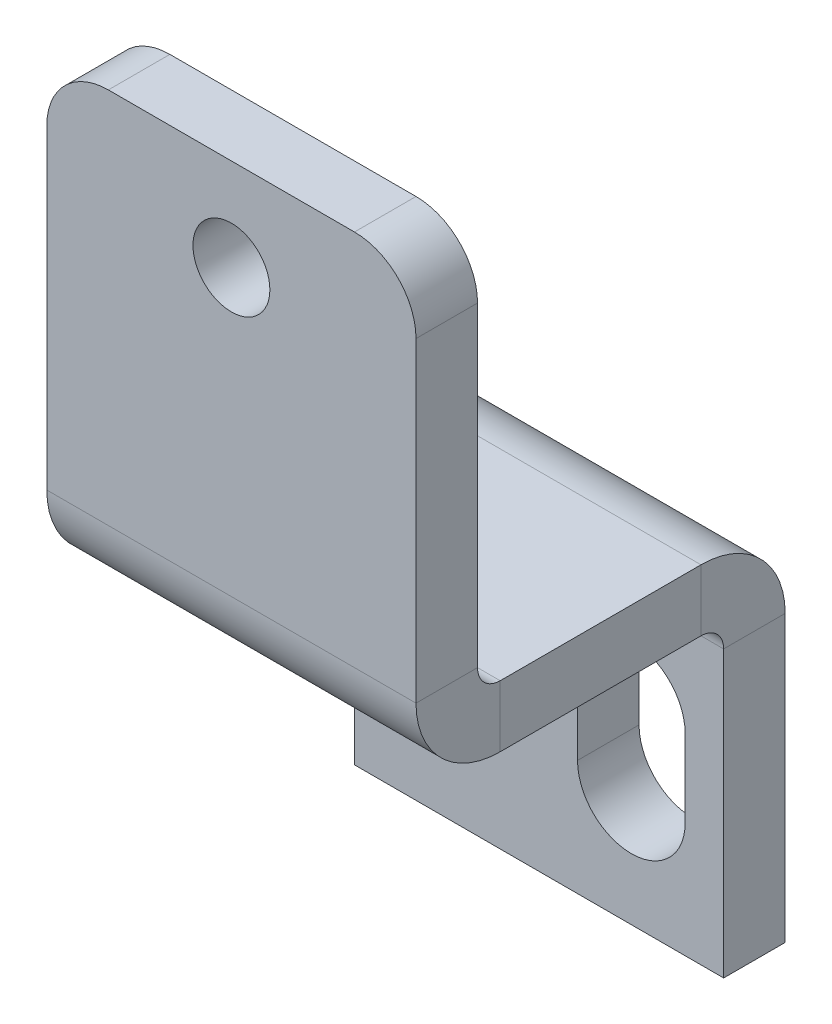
ISO-10303-21;
HEADER;
FILE_DESCRIPTION(('STEP AP214'),'2;1');
FILE_NAME('part.step','',(''),(''),'','','');
FILE_SCHEMA(('AUTOMOTIVE_DESIGN { 1 0 10303 214 1 1 1 1 }'));
ENDSEC;
DATA;
#1=APPLICATION_CONTEXT('core data for automotive mechanical design processes');
#2=APPLICATION_PROTOCOL_DEFINITION('international standard','automotive_design',2000,#1);
#3=PRODUCT_CONTEXT('',#1,'mechanical');
#4=PRODUCT('Part','Part','',(#3));
#5=PRODUCT_RELATED_PRODUCT_CATEGORY('part','',(#4));
#6=PRODUCT_DEFINITION_FORMATION('','',#4);
#7=PRODUCT_DEFINITION_CONTEXT('part definition',#1,'design');
#8=PRODUCT_DEFINITION('design','',#6,#7);
#9=PRODUCT_DEFINITION_SHAPE('','',#8);
#10=(LENGTH_UNIT() NAMED_UNIT(*) SI_UNIT(.MILLI.,.METRE.));
#11=(NAMED_UNIT(*) PLANE_ANGLE_UNIT() SI_UNIT($,.RADIAN.));
#12=(NAMED_UNIT(*) SI_UNIT($,.STERADIAN.) SOLID_ANGLE_UNIT());
#13=UNCERTAINTY_MEASURE_WITH_UNIT(LENGTH_MEASURE(1.E-05),#10,'distance_accuracy_value','');
#14=(GEOMETRIC_REPRESENTATION_CONTEXT(3) GLOBAL_UNCERTAINTY_ASSIGNED_CONTEXT((#13)) GLOBAL_UNIT_ASSIGNED_CONTEXT((#10,
#11,#12)) REPRESENTATION_CONTEXT('',''));
#15=CARTESIAN_POINT('',(0.,0.,0.));
#16=DIRECTION('',(0.,0.,1.));
#17=DIRECTION('',(1.,0.,0.));
#18=AXIS2_PLACEMENT_3D('',#15,#16,#17);
#19=CARTESIAN_POINT('',(0.,0.,0.));
#20=DIRECTION('',(0.,0.,1.));
#21=DIRECTION('',(1.,0.,0.));
#22=AXIS2_PLACEMENT_3D('',#19,#20,#21);
#23=PLANE('',#22);
#24=DIRECTION('',(0.,1.,0.));
#25=VECTOR('',#24,1.);
#26=CARTESIAN_POINT('',(317.25,15.0793919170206,0.));
#27=LINE('',#26,#25);
#28=CARTESIAN_POINT('',(317.25,15.0793919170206,0.));
#29=VERTEX_POINT('',#28);
#30=CARTESIAN_POINT('',(317.25,17.5793919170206,0.));
#31=VERTEX_POINT('',#30);
#32=EDGE_CURVE('E203',#29,#31,#27,.T.);
#33=ORIENTED_EDGE('',*,*,#32,.T.);
#34=CARTESIAN_POINT('',(319.,17.5793919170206,0.));
#35=DIRECTION('',(0.,0.,1.));
#36=DIRECTION('',(1.,0.,0.));
#37=AXIS2_PLACEMENT_3D('',#34,#35,#36);
#38=CIRCLE('',#37,1.74999999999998);
#39=CARTESIAN_POINT('',(320.75,17.5793919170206,0.));
#40=VERTEX_POINT('',#39);
#41=EDGE_CURVE('E219',#40,#31,#38,.T.);
#42=ORIENTED_EDGE('',*,*,#41,.F.);
#43=DIRECTION('',(0.,1.,0.));
#44=VECTOR('',#43,1.);
#45=CARTESIAN_POINT('',(320.75,15.0793919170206,0.));
#46=LINE('',#45,#44);
#47=CARTESIAN_POINT('',(320.75,15.0793919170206,0.));
#48=VERTEX_POINT('',#47);
#49=EDGE_CURVE('E196',#48,#40,#46,.T.);
#50=ORIENTED_EDGE('',*,*,#49,.F.);
#51=CARTESIAN_POINT('',(319.,15.0793919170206,0.));
#52=DIRECTION('',(0.,0.,1.));
#53=DIRECTION('',(1.,0.,0.));
#54=AXIS2_PLACEMENT_3D('',#51,#52,#53);
#55=CIRCLE('',#54,1.74999999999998);
#56=EDGE_CURVE('E209',#29,#48,#55,.T.);
#57=ORIENTED_EDGE('',*,*,#56,.F.);
#58=EDGE_LOOP('',(#33,#42,#50,#57));
#59=FACE_BOUND('',#58,.T.);
#60=DIRECTION('',(0.,1.,0.));
#61=VECTOR('',#60,1.);
#62=CARTESIAN_POINT('',(322.,23.3293919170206,0.));
#63=LINE('',#62,#61);
#64=CARTESIAN_POINT('',(322.,11.3293919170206,0.));
#65=VERTEX_POINT('',#64);
#66=CARTESIAN_POINT('',(322.,20.5927919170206,0.));
#67=VERTEX_POINT('',#66);
#68=EDGE_CURVE('E329',#65,#67,#63,.T.);
#69=ORIENTED_EDGE('',*,*,#68,.T.);
#70=DIRECTION('',(-1.,0.,0.));
#71=VECTOR('',#70,1.);
#72=CARTESIAN_POINT('',(310.,20.5927919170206,0.));
#73=LINE('',#72,#71);
#74=CARTESIAN_POINT('',(310.,20.5927919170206,0.));
#75=VERTEX_POINT('',#74);
#76=EDGE_CURVE('E315',#75,#67,#73,.F.);
#77=ORIENTED_EDGE('',*,*,#76,.F.);
#78=DIRECTION('',(0.,-1.,0.));
#79=VECTOR('',#78,1.);
#80=CARTESIAN_POINT('',(310.,11.3293919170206,0.));
#81=LINE('',#80,#79);
#82=CARTESIAN_POINT('',(310.,11.3293919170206,0.));
#83=VERTEX_POINT('',#82);
#84=EDGE_CURVE('E323',#75,#83,#81,.T.);
#85=ORIENTED_EDGE('',*,*,#84,.T.);
#86=DIRECTION('',(1.,0.,0.));
#87=VECTOR('',#86,1.);
#88=CARTESIAN_POINT('',(322.,11.3293919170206,0.));
#89=LINE('',#88,#87);
#90=EDGE_CURVE('E337',#83,#65,#89,.T.);
#91=ORIENTED_EDGE('',*,*,#90,.T.);
#92=EDGE_LOOP('',(#69,#77,#85,#91));
#93=FACE_BOUND('',#92,.T.);
#94=CARTESIAN_POINT('',(313.,15.0793919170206,0.));
#95=DIRECTION('',(0.,0.,1.));
#96=DIRECTION('',(1.,0.,0.));
#97=AXIS2_PLACEMENT_3D('',#94,#95,#96);
#98=CIRCLE('',#97,1.74999999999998);
#99=CARTESIAN_POINT('',(311.25,15.0793919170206,0.));
#100=VERTEX_POINT('',#99);
#101=CARTESIAN_POINT('',(314.75,15.0793919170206,0.));
#102=VERTEX_POINT('',#101);
#103=EDGE_CURVE('E176',#100,#102,#98,.T.);
#104=ORIENTED_EDGE('',*,*,#103,.F.);
#105=DIRECTION('',(0.,1.,0.));
#106=VECTOR('',#105,1.);
#107=CARTESIAN_POINT('',(311.25,15.0793919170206,0.));
#108=LINE('',#107,#106);
#109=CARTESIAN_POINT('',(311.25,17.5793919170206,0.));
#110=VERTEX_POINT('',#109);
#111=EDGE_CURVE('E178',#100,#110,#108,.T.);
#112=ORIENTED_EDGE('',*,*,#111,.T.);
#113=CARTESIAN_POINT('',(313.,17.5793919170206,0.));
#114=DIRECTION('',(0.,0.,1.));
#115=DIRECTION('',(1.,0.,0.));
#116=AXIS2_PLACEMENT_3D('',#113,#114,#115);
#117=CIRCLE('',#116,1.74999999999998);
#118=CARTESIAN_POINT('',(314.75,17.5793919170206,0.));
#119=VERTEX_POINT('',#118);
#120=EDGE_CURVE('E189',#119,#110,#117,.T.);
#121=ORIENTED_EDGE('',*,*,#120,.F.);
#122=DIRECTION('',(0.,1.,0.));
#123=VECTOR('',#122,1.);
#124=CARTESIAN_POINT('',(314.75,15.0793919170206,0.));
#125=LINE('',#124,#123);
#126=EDGE_CURVE('E172',#102,#119,#125,.T.);
#127=ORIENTED_EDGE('',*,*,#126,.F.);
#128=EDGE_LOOP('',(#104,#112,#121,#127));
#129=FACE_BOUND('',#128,.T.);
#130=ADVANCED_FACE('F16',(#59,#93,#129),#23,.T.);
#131=CARTESIAN_POINT('',(322.,23.3293919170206,0.));
#132=DIRECTION('',(-1.,0.,0.));
#133=DIRECTION('',(0.,-1.,0.));
#134=AXIS2_PLACEMENT_3D('',#131,#132,#133);
#135=PLANE('',#134);
#136=DIRECTION('',(0.,-1.,0.));
#137=VECTOR('',#136,1.);
#138=CARTESIAN_POINT('',(322.,23.3293919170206,7.2634));
#139=LINE('',#138,#137);
#140=CARTESIAN_POINT('',(322.,23.3293919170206,7.2634));
#141=VERTEX_POINT('',#140);
#142=CARTESIAN_POINT('',(322.,21.3293919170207,7.2634));
#143=VERTEX_POINT('',#142);
#144=EDGE_CURVE('E266',#141,#143,#139,.T.);
#145=ORIENTED_EDGE('',*,*,#144,.T.);
#146=DIRECTION('',(0.,0.,1.));
#147=VECTOR('',#146,1.);
#148=CARTESIAN_POINT('',(322.,21.3293919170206,0.));
#149=LINE('',#148,#147);
#150=CARTESIAN_POINT('',(322.,21.3293919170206,0.7366));
#151=VERTEX_POINT('',#150);
#152=EDGE_CURVE('E291',#143,#151,#149,.F.);
#153=ORIENTED_EDGE('',*,*,#152,.T.);
#154=DIRECTION('',(0.,-1.,0.));
#155=VECTOR('',#154,1.);
#156=CARTESIAN_POINT('',(322.,23.3293919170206,0.73659999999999));
#157=LINE('',#156,#155);
#158=CARTESIAN_POINT('',(322.,23.3293919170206,0.73659999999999));
#159=VERTEX_POINT('',#158);
#160=EDGE_CURVE('E279',#151,#159,#157,.F.);
#161=ORIENTED_EDGE('',*,*,#160,.T.);
#162=DIRECTION('',(0.,0.,-1.));
#163=VECTOR('',#162,1.);
#164=CARTESIAN_POINT('',(322.,23.3293919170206,0.));
#165=LINE('',#164,#163);
#166=EDGE_CURVE('E286',#141,#159,#165,.T.);
#167=ORIENTED_EDGE('',*,*,#166,.F.);
#168=EDGE_LOOP('',(#145,#153,#161,#167));
#169=FACE_BOUND('',#168,.T.);
#170=ADVANCED_FACE('F418',(#169),#135,.F.);
#171=CARTESIAN_POINT('',(310.,23.3293919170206,10.));
#172=DIRECTION('',(1.,0.,0.));
#173=DIRECTION('',(0.,1.,0.));
#174=AXIS2_PLACEMENT_3D('',#171,#172,#173);
#175=PLANE('',#174);
#176=DIRECTION('',(0.,-1.,0.));
#177=VECTOR('',#176,1.);
#178=CARTESIAN_POINT('',(310.,23.3293919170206,7.2634));
#179=LINE('',#178,#177);
#180=CARTESIAN_POINT('',(310.,23.3293919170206,7.2634));
#181=VERTEX_POINT('',#180);
#182=CARTESIAN_POINT('',(310.,21.3293919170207,7.2634));
#183=VERTEX_POINT('',#182);
#184=EDGE_CURVE('E276',#181,#183,#179,.T.);
#185=ORIENTED_EDGE('',*,*,#184,.F.);
#186=DIRECTION('',(0.,0.,1.));
#187=VECTOR('',#186,1.);
#188=CARTESIAN_POINT('',(310.,23.3293919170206,0.));
#189=LINE('',#188,#187);
#190=CARTESIAN_POINT('',(310.,23.3293919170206,0.73659999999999));
#191=VERTEX_POINT('',#190);
#192=EDGE_CURVE('E282',#191,#181,#189,.T.);
#193=ORIENTED_EDGE('',*,*,#192,.F.);
#194=DIRECTION('',(0.,-1.,0.));
#195=VECTOR('',#194,1.);
#196=CARTESIAN_POINT('',(310.,21.3293919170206,0.7366));
#197=LINE('',#196,#195);
#198=CARTESIAN_POINT('',(310.,21.3293919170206,0.7366));
#199=VERTEX_POINT('',#198);
#200=EDGE_CURVE('E296',#199,#191,#197,.F.);
#201=ORIENTED_EDGE('',*,*,#200,.F.);
#202=DIRECTION('',(0.,0.,-1.));
#203=VECTOR('',#202,1.);
#204=CARTESIAN_POINT('',(310.,21.3293919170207,10.));
#205=LINE('',#204,#203);
#206=EDGE_CURVE('E288',#199,#183,#205,.F.);
#207=ORIENTED_EDGE('',*,*,#206,.T.);
#208=EDGE_LOOP('',(#185,#193,#201,#207));
#209=FACE_BOUND('',#208,.T.);
#210=ADVANCED_FACE('F402',(#209),#175,.F.);
#211=CARTESIAN_POINT('',(0.,23.3293919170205,0.));
#212=DIRECTION('',(0.,-1.,0.));
#213=DIRECTION('',(0.,0.,-1.));
#214=AXIS2_PLACEMENT_3D('',#211,#212,#213);
#215=PLANE('',#214);
#216=DIRECTION('',(1.,0.,0.));
#217=VECTOR('',#216,1.);
#218=CARTESIAN_POINT('',(322.,23.3293919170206,7.2634));
#219=LINE('',#218,#217);
#220=EDGE_CURVE('E272',#141,#181,#219,.F.);
#221=ORIENTED_EDGE('',*,*,#220,.F.);
#222=ORIENTED_EDGE('',*,*,#166,.T.);
#223=DIRECTION('',(-1.,0.,0.));
#224=VECTOR('',#223,1.);
#225=CARTESIAN_POINT('',(322.,23.3293919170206,0.73659999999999));
#226=LINE('',#225,#224);
#227=EDGE_CURVE('E293',#191,#159,#226,.F.);
#228=ORIENTED_EDGE('',*,*,#227,.F.);
#229=ORIENTED_EDGE('',*,*,#192,.T.);
#230=EDGE_LOOP('',(#221,#222,#228,#229));
#231=FACE_BOUND('',#230,.T.);
#232=ADVANCED_FACE('F407',(#231),#215,.F.);
#233=CARTESIAN_POINT('',(0.,21.3293919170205,0.));
#234=DIRECTION('',(0.,-1.,0.));
#235=DIRECTION('',(0.,0.,-1.));
#236=AXIS2_PLACEMENT_3D('',#233,#234,#235);
#237=PLANE('',#236);
#238=ORIENTED_EDGE('',*,*,#152,.F.);
#239=DIRECTION('',(1.,0.,0.));
#240=VECTOR('',#239,1.);
#241=CARTESIAN_POINT('',(322.,21.3293919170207,7.2634));
#242=LINE('',#241,#240);
#243=EDGE_CURVE('E259',#143,#183,#242,.F.);
#244=ORIENTED_EDGE('',*,*,#243,.T.);
#245=ORIENTED_EDGE('',*,*,#206,.F.);
#246=DIRECTION('',(-1.,0.,0.));
#247=VECTOR('',#246,1.);
#248=CARTESIAN_POINT('',(322.,21.3293919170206,0.7366));
#249=LINE('',#248,#247);
#250=EDGE_CURVE('E299',#151,#199,#249,.T.);
#251=ORIENTED_EDGE('',*,*,#250,.F.);
#252=EDGE_LOOP('',(#238,#244,#245,#251));
#253=FACE_BOUND('',#252,.T.);
#254=ADVANCED_FACE('F422',(#253),#237,.T.);
#255=CARTESIAN_POINT('',(310.,11.3293919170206,-2.));
#256=DIRECTION('',(-1.,0.,0.));
#257=DIRECTION('',(0.,0.,1.));
#258=AXIS2_PLACEMENT_3D('',#255,#256,#257);
#259=PLANE('',#258);
#260=ORIENTED_EDGE('',*,*,#84,.F.);
#261=DIRECTION('',(0.,0.,-1.));
#262=VECTOR('',#261,1.);
#263=CARTESIAN_POINT('',(310.,20.5927919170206,0.));
#264=LINE('',#263,#262);
#265=CARTESIAN_POINT('',(310.,20.5927919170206,-2.));
#266=VERTEX_POINT('',#265);
#267=EDGE_CURVE('E309',#75,#266,#264,.T.);
#268=ORIENTED_EDGE('',*,*,#267,.T.);
#269=DIRECTION('',(0.,-1.,0.));
#270=VECTOR('',#269,1.);
#271=CARTESIAN_POINT('',(310.,11.3293919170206,-2.));
#272=LINE('',#271,#270);
#273=CARTESIAN_POINT('',(310.,11.3293919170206,-2.));
#274=VERTEX_POINT('',#273);
#275=EDGE_CURVE('E326',#266,#274,#272,.T.);
#276=ORIENTED_EDGE('',*,*,#275,.T.);
#277=DIRECTION('',(0.,0.,1.));
#278=VECTOR('',#277,1.);
#279=CARTESIAN_POINT('',(310.,11.3293919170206,-2.));
#280=LINE('',#279,#278);
#281=EDGE_CURVE('E335',#274,#83,#280,.T.);
#282=ORIENTED_EDGE('',*,*,#281,.T.);
#283=EDGE_LOOP('',(#260,#268,#276,#282));
#284=FACE_BOUND('',#283,.T.);
#285=ADVANCED_FACE('F431',(#284),#259,.T.);
#286=CARTESIAN_POINT('',(0.,0.,-2.));
#287=DIRECTION('',(0.,0.,1.));
#288=DIRECTION('',(1.,0.,0.));
#289=AXIS2_PLACEMENT_3D('',#286,#287,#288);
#290=PLANE('',#289);
#291=DIRECTION('',(0.,1.,0.));
#292=VECTOR('',#291,1.);
#293=CARTESIAN_POINT('',(314.75,15.0793919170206,-2.));
#294=LINE('',#293,#292);
#295=CARTESIAN_POINT('',(314.75,15.0793919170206,-2.));
#296=VERTEX_POINT('',#295);
#297=CARTESIAN_POINT('',(314.75,17.5793919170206,-2.));
#298=VERTEX_POINT('',#297);
#299=EDGE_CURVE('E165',#296,#298,#294,.T.);
#300=ORIENTED_EDGE('',*,*,#299,.T.);
#301=CARTESIAN_POINT('',(313.,17.5793919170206,-2.));
#302=DIRECTION('',(0.,0.,1.));
#303=DIRECTION('',(1.,0.,0.));
#304=AXIS2_PLACEMENT_3D('',#301,#302,#303);
#305=CIRCLE('',#304,1.74999999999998);
#306=CARTESIAN_POINT('',(311.25,17.5793919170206,-2.));
#307=VERTEX_POINT('',#306);
#308=EDGE_CURVE('E192',#298,#307,#305,.T.);
#309=ORIENTED_EDGE('',*,*,#308,.T.);
#310=DIRECTION('',(0.,1.,0.));
#311=VECTOR('',#310,1.);
#312=CARTESIAN_POINT('',(311.25,15.0793919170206,-2.));
#313=LINE('',#312,#311);
#314=CARTESIAN_POINT('',(311.25,15.0793919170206,-2.));
#315=VERTEX_POINT('',#314);
#316=EDGE_CURVE('E171',#315,#307,#313,.T.);
#317=ORIENTED_EDGE('',*,*,#316,.F.);
#318=CARTESIAN_POINT('',(313.,15.0793919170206,-2.));
#319=DIRECTION('',(0.,0.,1.));
#320=DIRECTION('',(1.,0.,0.));
#321=AXIS2_PLACEMENT_3D('',#318,#319,#320);
#322=CIRCLE('',#321,1.74999999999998);
#323=EDGE_CURVE('E31',#315,#296,#322,.T.);
#324=ORIENTED_EDGE('',*,*,#323,.T.);
#325=EDGE_LOOP('',(#300,#309,#317,#324));
#326=FACE_BOUND('',#325,.T.);
#327=DIRECTION('',(0.,1.,0.));
#328=VECTOR('',#327,1.);
#329=CARTESIAN_POINT('',(320.75,15.0793919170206,-2.));
#330=LINE('',#329,#328);
#331=CARTESIAN_POINT('',(320.75,15.0793919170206,-2.));
#332=VERTEX_POINT('',#331);
#333=CARTESIAN_POINT('',(320.75,17.5793919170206,-2.));
#334=VERTEX_POINT('',#333);
#335=EDGE_CURVE('E198',#332,#334,#330,.T.);
#336=ORIENTED_EDGE('',*,*,#335,.T.);
#337=CARTESIAN_POINT('',(319.,17.5793919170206,-2.));
#338=DIRECTION('',(0.,0.,1.));
#339=DIRECTION('',(1.,0.,0.));
#340=AXIS2_PLACEMENT_3D('',#337,#338,#339);
#341=CIRCLE('',#340,1.74999999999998);
#342=CARTESIAN_POINT('',(317.25,17.5793919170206,-2.));
#343=VERTEX_POINT('',#342);
#344=EDGE_CURVE('E222',#334,#343,#341,.T.);
#345=ORIENTED_EDGE('',*,*,#344,.T.);
#346=DIRECTION('',(0.,1.,0.));
#347=VECTOR('',#346,1.);
#348=CARTESIAN_POINT('',(317.25,15.0793919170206,-2.));
#349=LINE('',#348,#347);
#350=CARTESIAN_POINT('',(317.25,15.0793919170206,-2.));
#351=VERTEX_POINT('',#350);
#352=EDGE_CURVE('E201',#351,#343,#349,.T.);
#353=ORIENTED_EDGE('',*,*,#352,.F.);
#354=CARTESIAN_POINT('',(319.,15.0793919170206,-2.));
#355=DIRECTION('',(0.,0.,1.));
#356=DIRECTION('',(1.,0.,0.));
#357=AXIS2_PLACEMENT_3D('',#354,#355,#356);
#358=CIRCLE('',#357,1.74999999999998);
#359=EDGE_CURVE('E212',#351,#332,#358,.T.);
#360=ORIENTED_EDGE('',*,*,#359,.T.);
#361=EDGE_LOOP('',(#336,#345,#353,#360));
#362=FACE_BOUND('',#361,.T.);
#363=DIRECTION('',(-1.,0.,0.));
#364=VECTOR('',#363,1.);
#365=CARTESIAN_POINT('',(310.,20.5927919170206,-2.));
#366=LINE('',#365,#364);
#367=CARTESIAN_POINT('',(322.,20.5927919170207,-2.));
#368=VERTEX_POINT('',#367);
#369=EDGE_CURVE('E303',#266,#368,#366,.F.);
#370=ORIENTED_EDGE('',*,*,#369,.T.);
#371=DIRECTION('',(0.,1.,0.));
#372=VECTOR('',#371,1.);
#373=CARTESIAN_POINT('',(322.,23.3293919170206,-2.));
#374=LINE('',#373,#372);
#375=CARTESIAN_POINT('',(322.,11.3293919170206,-2.));
#376=VERTEX_POINT('',#375);
#377=EDGE_CURVE('E332',#376,#368,#374,.T.);
#378=ORIENTED_EDGE('',*,*,#377,.F.);
#379=DIRECTION('',(1.,0.,0.));
#380=VECTOR('',#379,1.);
#381=CARTESIAN_POINT('',(322.,11.3293919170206,-2.));
#382=LINE('',#381,#380);
#383=EDGE_CURVE('E328',#274,#376,#382,.T.);
#384=ORIENTED_EDGE('',*,*,#383,.F.);
#385=ORIENTED_EDGE('',*,*,#275,.F.);
#386=EDGE_LOOP('',(#370,#378,#384,#385));
#387=FACE_BOUND('',#386,.T.);
#388=ADVANCED_FACE('F181',(#326,#362,#387),#290,.F.);
#389=CARTESIAN_POINT('',(322.,23.3293919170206,-2.));
#390=DIRECTION('',(1.,0.,0.));
#391=DIRECTION('',(0.,0.,-1.));
#392=AXIS2_PLACEMENT_3D('',#389,#390,#391);
#393=PLANE('',#392);
#394=DIRECTION('',(0.,0.,-1.));
#395=VECTOR('',#394,1.);
#396=CARTESIAN_POINT('',(322.,20.5927919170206,0.));
#397=LINE('',#396,#395);
#398=EDGE_CURVE('E320',#67,#368,#397,.T.);
#399=ORIENTED_EDGE('',*,*,#398,.F.);
#400=ORIENTED_EDGE('',*,*,#68,.F.);
#401=DIRECTION('',(0.,0.,1.));
#402=VECTOR('',#401,1.);
#403=CARTESIAN_POINT('',(322.,11.3293919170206,-2.));
#404=LINE('',#403,#402);
#405=EDGE_CURVE('E342',#376,#65,#404,.T.);
#406=ORIENTED_EDGE('',*,*,#405,.F.);
#407=ORIENTED_EDGE('',*,*,#377,.T.);
#408=EDGE_LOOP('',(#399,#400,#406,#407));
#409=FACE_BOUND('',#408,.T.);
#410=ADVANCED_FACE('F437',(#409),#393,.T.);
#411=CARTESIAN_POINT('',(322.,11.3293919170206,-2.));
#412=DIRECTION('',(0.,-1.,0.));
#413=DIRECTION('',(0.,0.,-1.));
#414=AXIS2_PLACEMENT_3D('',#411,#412,#413);
#415=PLANE('',#414);
#416=ORIENTED_EDGE('',*,*,#90,.F.);
#417=ORIENTED_EDGE('',*,*,#281,.F.);
#418=ORIENTED_EDGE('',*,*,#383,.T.);
#419=ORIENTED_EDGE('',*,*,#405,.T.);
#420=EDGE_LOOP('',(#416,#417,#418,#419));
#421=FACE_BOUND('',#420,.T.);
#422=ADVANCED_FACE('F441',(#421),#415,.T.);
#423=CARTESIAN_POINT('',(322.,20.5927919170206,0.7366));
#424=DIRECTION('',(1.,0.,0.));
#425=DIRECTION('',(0.,0.,-1.));
#426=AXIS2_PLACEMENT_3D('',#423,#424,#425);
#427=PLANE('',#426);
#428=ORIENTED_EDGE('',*,*,#160,.F.);
#429=CARTESIAN_POINT('',(322.,20.5927919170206,0.7366));
#430=DIRECTION('',(-1.,0.,0.));
#431=DIRECTION('',(0.,0.,1.));
#432=AXIS2_PLACEMENT_3D('',#429,#430,#431);
#433=CIRCLE('',#432,0.7366);
#434=EDGE_CURVE('E312',#67,#151,#433,.F.);
#435=ORIENTED_EDGE('',*,*,#434,.F.);
#436=ORIENTED_EDGE('',*,*,#398,.T.);
#437=CARTESIAN_POINT('',(322.,20.5927919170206,0.7366));
#438=DIRECTION('',(-1.,0.,0.));
#439=DIRECTION('',(0.,0.,1.));
#440=AXIS2_PLACEMENT_3D('',#437,#438,#439);
#441=CIRCLE('',#440,2.7366);
#442=EDGE_CURVE('E305',#368,#159,#441,.F.);
#443=ORIENTED_EDGE('',*,*,#442,.T.);
#444=EDGE_LOOP('',(#428,#435,#436,#443));
#445=FACE_BOUND('',#444,.T.);
#446=ADVANCED_FACE('F415',(#445),#427,.T.);
#447=CARTESIAN_POINT('',(310.,20.5927919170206,0.7366));
#448=DIRECTION('',(1.,0.,0.));
#449=DIRECTION('',(0.,0.,-1.));
#450=AXIS2_PLACEMENT_3D('',#447,#448,#449);
#451=PLANE('',#450);
#452=CARTESIAN_POINT('',(310.,20.5927919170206,0.7366));
#453=DIRECTION('',(-1.,0.,0.));
#454=DIRECTION('',(0.,0.,1.));
#455=AXIS2_PLACEMENT_3D('',#452,#453,#454);
#456=CIRCLE('',#455,0.7366);
#457=EDGE_CURVE('E285',#199,#75,#456,.T.);
#458=ORIENTED_EDGE('',*,*,#457,.F.);
#459=ORIENTED_EDGE('',*,*,#200,.T.);
#460=CARTESIAN_POINT('',(310.,20.5927919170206,0.7366));
#461=DIRECTION('',(-1.,0.,0.));
#462=DIRECTION('',(0.,0.,1.));
#463=AXIS2_PLACEMENT_3D('',#460,#461,#462);
#464=CIRCLE('',#463,2.7366);
#465=EDGE_CURVE('E306',#191,#266,#464,.T.);
#466=ORIENTED_EDGE('',*,*,#465,.T.);
#467=ORIENTED_EDGE('',*,*,#267,.F.);
#468=EDGE_LOOP('',(#458,#459,#466,#467));
#469=FACE_BOUND('',#468,.T.);
#470=ADVANCED_FACE('F428',(#469),#451,.F.);
#471=CARTESIAN_POINT('',(310.,20.5927919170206,0.7366));
#472=DIRECTION('',(-1.,0.,0.));
#473=DIRECTION('',(0.,1.,0.));
#474=AXIS2_PLACEMENT_3D('',#471,#472,#473);
#475=CYLINDRICAL_SURFACE('',#474,2.7366);
#476=ORIENTED_EDGE('',*,*,#369,.F.);
#477=ORIENTED_EDGE('',*,*,#465,.F.);
#478=ORIENTED_EDGE('',*,*,#227,.T.);
#479=ORIENTED_EDGE('',*,*,#442,.F.);
#480=EDGE_LOOP('',(#476,#477,#478,#479));
#481=FACE_BOUND('',#480,.T.);
#482=ADVANCED_FACE('F412',(#481),#475,.T.);
#483=CARTESIAN_POINT('',(310.,20.5927919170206,0.7366));
#484=DIRECTION('',(-1.,0.,0.));
#485=DIRECTION('',(0.,1.,0.));
#486=AXIS2_PLACEMENT_3D('',#483,#484,#485);
#487=CYLINDRICAL_SURFACE('',#486,0.7366);
#488=ORIENTED_EDGE('',*,*,#76,.T.);
#489=ORIENTED_EDGE('',*,*,#434,.T.);
#490=ORIENTED_EDGE('',*,*,#250,.T.);
#491=ORIENTED_EDGE('',*,*,#457,.T.);
#492=EDGE_LOOP('',(#488,#489,#490,#491));
#493=FACE_BOUND('',#492,.T.);
#494=ADVANCED_FACE('F425',(#493),#487,.F.);
#495=CARTESIAN_POINT('',(310.,24.0659919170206,7.2634));
#496=DIRECTION('',(-1.,0.,0.));
#497=DIRECTION('',(0.,0.,1.));
#498=AXIS2_PLACEMENT_3D('',#495,#496,#497);
#499=PLANE('',#498);
#500=DIRECTION('',(0.,0.,-1.));
#501=VECTOR('',#500,1.);
#502=CARTESIAN_POINT('',(310.,24.0659919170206,10.));
#503=LINE('',#502,#501);
#504=CARTESIAN_POINT('',(310.,24.0659919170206,8.));
#505=VERTEX_POINT('',#504);
#506=CARTESIAN_POINT('',(310.,24.0659919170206,10.));
#507=VERTEX_POINT('',#506);
#508=EDGE_CURVE('E256',#505,#507,#503,.F.);
#509=ORIENTED_EDGE('',*,*,#508,.F.);
#510=CARTESIAN_POINT('',(310.,24.0659919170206,7.2634));
#511=DIRECTION('',(1.,0.,0.));
#512=DIRECTION('',(0.,0.,-1.));
#513=AXIS2_PLACEMENT_3D('',#510,#511,#512);
#514=CIRCLE('',#513,0.7366);
#515=EDGE_CURVE('E269',#181,#505,#514,.F.);
#516=ORIENTED_EDGE('',*,*,#515,.F.);
#517=ORIENTED_EDGE('',*,*,#184,.T.);
#518=CARTESIAN_POINT('',(310.,24.0659919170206,7.2634));
#519=DIRECTION('',(1.,0.,0.));
#520=DIRECTION('',(0.,0.,-1.));
#521=AXIS2_PLACEMENT_3D('',#518,#519,#520);
#522=CIRCLE('',#521,2.7366);
#523=EDGE_CURVE('E262',#183,#507,#522,.F.);
#524=ORIENTED_EDGE('',*,*,#523,.T.);
#525=EDGE_LOOP('',(#509,#516,#517,#524));
#526=FACE_BOUND('',#525,.T.);
#527=ADVANCED_FACE('F390',(#526),#499,.T.);
#528=CARTESIAN_POINT('',(322.,24.0659919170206,7.2634));
#529=DIRECTION('',(-1.,0.,0.));
#530=DIRECTION('',(0.,0.,1.));
#531=AXIS2_PLACEMENT_3D('',#528,#529,#530);
#532=PLANE('',#531);
#533=CARTESIAN_POINT('',(322.,24.0659919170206,7.2634));
#534=DIRECTION('',(1.,0.,0.));
#535=DIRECTION('',(0.,0.,-1.));
#536=AXIS2_PLACEMENT_3D('',#533,#534,#535);
#537=CIRCLE('',#536,0.7366);
#538=CARTESIAN_POINT('',(322.,24.0659919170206,8.));
#539=VERTEX_POINT('',#538);
#540=EDGE_CURVE('E234',#539,#141,#537,.T.);
#541=ORIENTED_EDGE('',*,*,#540,.F.);
#542=DIRECTION('',(0.,0.,-1.));
#543=VECTOR('',#542,1.);
#544=CARTESIAN_POINT('',(322.,24.0659919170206,8.));
#545=LINE('',#544,#543);
#546=CARTESIAN_POINT('',(322.,24.0659919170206,10.));
#547=VERTEX_POINT('',#546);
#548=EDGE_CURVE('E251',#539,#547,#545,.F.);
#549=ORIENTED_EDGE('',*,*,#548,.T.);
#550=CARTESIAN_POINT('',(322.,24.0659919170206,7.2634));
#551=DIRECTION('',(1.,0.,0.));
#552=DIRECTION('',(0.,0.,-1.));
#553=AXIS2_PLACEMENT_3D('',#550,#551,#552);
#554=CIRCLE('',#553,2.7366);
#555=EDGE_CURVE('E263',#547,#143,#554,.T.);
#556=ORIENTED_EDGE('',*,*,#555,.T.);
#557=ORIENTED_EDGE('',*,*,#144,.F.);
#558=EDGE_LOOP('',(#541,#549,#556,#557));
#559=FACE_BOUND('',#558,.T.);
#560=ADVANCED_FACE('F384',(#559),#532,.F.);
#561=CARTESIAN_POINT('',(322.,24.0659919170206,7.2634));
#562=DIRECTION('',(1.,0.,0.));
#563=DIRECTION('',(0.,0.,1.));
#564=AXIS2_PLACEMENT_3D('',#561,#562,#563);
#565=CYLINDRICAL_SURFACE('',#564,2.7366);
#566=ORIENTED_EDGE('',*,*,#243,.F.);
#567=ORIENTED_EDGE('',*,*,#555,.F.);
#568=DIRECTION('',(1.,0.,0.));
#569=VECTOR('',#568,1.);
#570=CARTESIAN_POINT('',(310.,24.0659919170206,10.));
#571=LINE('',#570,#569);
#572=EDGE_CURVE('E248',#547,#507,#571,.F.);
#573=ORIENTED_EDGE('',*,*,#572,.T.);
#574=ORIENTED_EDGE('',*,*,#523,.F.);
#575=EDGE_LOOP('',(#566,#567,#573,#574));
#576=FACE_BOUND('',#575,.T.);
#577=ADVANCED_FACE('F387',(#576),#565,.T.);
#578=CARTESIAN_POINT('',(322.,24.0659919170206,7.2634));
#579=DIRECTION('',(1.,0.,0.));
#580=DIRECTION('',(0.,0.,1.));
#581=AXIS2_PLACEMENT_3D('',#578,#579,#580);
#582=CYLINDRICAL_SURFACE('',#581,0.7366);
#583=ORIENTED_EDGE('',*,*,#220,.T.);
#584=ORIENTED_EDGE('',*,*,#515,.T.);
#585=DIRECTION('',(1.,0.,0.));
#586=VECTOR('',#585,1.);
#587=CARTESIAN_POINT('',(310.,24.0659919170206,8.));
#588=LINE('',#587,#586);
#589=EDGE_CURVE('E254',#505,#539,#588,.T.);
#590=ORIENTED_EDGE('',*,*,#589,.T.);
#591=ORIENTED_EDGE('',*,*,#540,.T.);
#592=EDGE_LOOP('',(#583,#584,#590,#591));
#593=FACE_BOUND('',#592,.T.);
#594=ADVANCED_FACE('F398',(#593),#582,.F.);
#595=CARTESIAN_POINT('',(310.,23.3293919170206,10.));
#596=DIRECTION('',(1.,0.,0.));
#597=DIRECTION('',(0.,0.,-1.));
#598=AXIS2_PLACEMENT_3D('',#595,#596,#597);
#599=PLANE('',#598);
#600=DIRECTION('',(0.,-1.,0.));
#601=VECTOR('',#600,1.);
#602=CARTESIAN_POINT('',(310.,0.,10.));
#603=LINE('',#602,#601);
#604=CARTESIAN_POINT('',(310.,34.3293919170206,10.));
#605=VERTEX_POINT('',#604);
#606=EDGE_CURVE('E238',#605,#507,#603,.T.);
#607=ORIENTED_EDGE('',*,*,#606,.F.);
#608=DIRECTION('',(0.,0.,-1.));
#609=VECTOR('',#608,1.);
#610=CARTESIAN_POINT('',(310.,34.3293919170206,10.));
#611=LINE('',#610,#609);
#612=CARTESIAN_POINT('',(310.,34.3293919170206,8.));
#613=VERTEX_POINT('',#612);
#614=EDGE_CURVE('E11',#605,#613,#611,.T.);
#615=ORIENTED_EDGE('',*,*,#614,.T.);
#616=DIRECTION('',(0.,1.,0.));
#617=VECTOR('',#616,1.);
#618=CARTESIAN_POINT('',(310.,23.3293919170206,8.));
#619=LINE('',#618,#617);
#620=EDGE_CURVE('E246',#613,#505,#619,.F.);
#621=ORIENTED_EDGE('',*,*,#620,.T.);
#622=ORIENTED_EDGE('',*,*,#508,.T.);
#623=EDGE_LOOP('',(#607,#615,#621,#622));
#624=FACE_BOUND('',#623,.T.);
#625=ADVANCED_FACE('F394',(#624),#599,.F.);
#626=CARTESIAN_POINT('',(322.,36.3293919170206,10.));
#627=DIRECTION('',(-1.,0.,0.));
#628=DIRECTION('',(0.,0.,1.));
#629=AXIS2_PLACEMENT_3D('',#626,#627,#628);
#630=PLANE('',#629);
#631=DIRECTION('',(0.,-1.,0.));
#632=VECTOR('',#631,1.);
#633=CARTESIAN_POINT('',(322.,36.3293919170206,8.));
#634=LINE('',#633,#632);
#635=CARTESIAN_POINT('',(322.,34.3293919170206,8.));
#636=VERTEX_POINT('',#635);
#637=EDGE_CURVE('E243',#539,#636,#634,.F.);
#638=ORIENTED_EDGE('',*,*,#637,.T.);
#639=DIRECTION('',(0.,0.,-1.));
#640=VECTOR('',#639,1.);
#641=CARTESIAN_POINT('',(322.,34.3293919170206,10.));
#642=LINE('',#641,#640);
#643=CARTESIAN_POINT('',(322.,34.3293919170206,10.));
#644=VERTEX_POINT('',#643);
#645=EDGE_CURVE('E357',#636,#644,#642,.F.);
#646=ORIENTED_EDGE('',*,*,#645,.T.);
#647=DIRECTION('',(0.,1.,0.));
#648=VECTOR('',#647,1.);
#649=CARTESIAN_POINT('',(322.,0.,10.));
#650=LINE('',#649,#648);
#651=EDGE_CURVE('E235',#547,#644,#650,.T.);
#652=ORIENTED_EDGE('',*,*,#651,.F.);
#653=ORIENTED_EDGE('',*,*,#548,.F.);
#654=EDGE_LOOP('',(#638,#646,#652,#653));
#655=FACE_BOUND('',#654,.T.);
#656=ADVANCED_FACE('F381',(#655),#630,.F.);
#657=CARTESIAN_POINT('',(0.,0.,10.));
#658=DIRECTION('',(0.,0.,-1.));
#659=DIRECTION('',(-1.,0.,0.));
#660=AXIS2_PLACEMENT_3D('',#657,#658,#659);
#661=PLANE('',#660);
#662=CARTESIAN_POINT('',(316.,33.3293919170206,10.));
#663=DIRECTION('',(0.,0.,1.));
#664=DIRECTION('',(1.,0.,0.));
#665=AXIS2_PLACEMENT_3D('',#662,#663,#664);
#666=CIRCLE('',#665,1.24999999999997);
#667=CARTESIAN_POINT('',(317.25,33.3293919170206,10.));
#668=VERTEX_POINT('',#667);
#669=EDGE_CURVE('E227',#668,#668,#666,.T.);
#670=ORIENTED_EDGE('',*,*,#669,.F.);
#671=EDGE_LOOP('',(#670));
#672=FACE_BOUND('',#671,.T.);
#673=ORIENTED_EDGE('',*,*,#651,.T.);
#674=CARTESIAN_POINT('',(320.,34.3293919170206,10.));
#675=DIRECTION('',(0.,0.,-1.));
#676=DIRECTION('',(-1.,0.,0.));
#677=AXIS2_PLACEMENT_3D('',#674,#675,#676);
#678=CIRCLE('',#677,2.);
#679=CARTESIAN_POINT('',(320.,36.3293919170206,10.));
#680=VERTEX_POINT('',#679);
#681=EDGE_CURVE('E24',#644,#680,#678,.F.);
#682=ORIENTED_EDGE('',*,*,#681,.T.);
#683=DIRECTION('',(-1.,0.,0.));
#684=VECTOR('',#683,1.);
#685=CARTESIAN_POINT('',(0.,36.3293919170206,10.));
#686=LINE('',#685,#684);
#687=CARTESIAN_POINT('',(312.,36.3293919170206,10.));
#688=VERTEX_POINT('',#687);
#689=EDGE_CURVE('E231',#680,#688,#686,.T.);
#690=ORIENTED_EDGE('',*,*,#689,.T.);
#691=CARTESIAN_POINT('',(312.,34.3293919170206,10.));
#692=DIRECTION('',(0.,0.,-1.));
#693=DIRECTION('',(-1.,0.,0.));
#694=AXIS2_PLACEMENT_3D('',#691,#692,#693);
#695=CIRCLE('',#694,2.);
#696=EDGE_CURVE('E359',#688,#605,#695,.F.);
#697=ORIENTED_EDGE('',*,*,#696,.T.);
#698=ORIENTED_EDGE('',*,*,#606,.T.);
#699=ORIENTED_EDGE('',*,*,#572,.F.);
#700=EDGE_LOOP('',(#673,#682,#690,#697,#698,#699));
#701=FACE_BOUND('',#700,.T.);
#702=ADVANCED_FACE('F363',(#672,#701),#661,.F.);
#703=CARTESIAN_POINT('',(0.,0.,8.));
#704=DIRECTION('',(0.,0.,-1.));
#705=DIRECTION('',(-1.,0.,0.));
#706=AXIS2_PLACEMENT_3D('',#703,#704,#705);
#707=PLANE('',#706);
#708=CARTESIAN_POINT('',(316.,33.3293919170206,8.));
#709=DIRECTION('',(0.,0.,-1.));
#710=DIRECTION('',(-1.,0.,0.));
#711=AXIS2_PLACEMENT_3D('',#708,#709,#710);
#712=CIRCLE('',#711,1.24999999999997);
#713=CARTESIAN_POINT('',(314.75,33.3293919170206,8.));
#714=VERTEX_POINT('',#713);
#715=EDGE_CURVE('E230',#714,#714,#712,.T.);
#716=ORIENTED_EDGE('',*,*,#715,.F.);
#717=EDGE_LOOP('',(#716));
#718=FACE_BOUND('',#717,.T.);
#719=DIRECTION('',(1.,0.,0.));
#720=VECTOR('',#719,1.);
#721=CARTESIAN_POINT('',(310.,36.3293919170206,8.));
#722=LINE('',#721,#720);
#723=CARTESIAN_POINT('',(320.,36.3293919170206,8.));
#724=VERTEX_POINT('',#723);
#725=CARTESIAN_POINT('',(312.,36.3293919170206,8.));
#726=VERTEX_POINT('',#725);
#727=EDGE_CURVE('E240',#724,#726,#722,.F.);
#728=ORIENTED_EDGE('',*,*,#727,.F.);
#729=CARTESIAN_POINT('',(320.,34.3293919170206,8.));
#730=DIRECTION('',(0.,0.,-1.));
#731=DIRECTION('',(-1.,0.,0.));
#732=AXIS2_PLACEMENT_3D('',#729,#730,#731);
#733=CIRCLE('',#732,2.);
#734=EDGE_CURVE('E355',#724,#636,#733,.T.);
#735=ORIENTED_EDGE('',*,*,#734,.T.);
#736=ORIENTED_EDGE('',*,*,#637,.F.);
#737=ORIENTED_EDGE('',*,*,#589,.F.);
#738=ORIENTED_EDGE('',*,*,#620,.F.);
#739=CARTESIAN_POINT('',(312.,34.3293919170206,8.));
#740=DIRECTION('',(0.,0.,-1.));
#741=DIRECTION('',(-1.,0.,0.));
#742=AXIS2_PLACEMENT_3D('',#739,#740,#741);
#743=CIRCLE('',#742,2.);
#744=EDGE_CURVE('E353',#613,#726,#743,.T.);
#745=ORIENTED_EDGE('',*,*,#744,.T.);
#746=EDGE_LOOP('',(#728,#735,#736,#737,#738,#745));
#747=FACE_BOUND('',#746,.T.);
#748=ADVANCED_FACE('F377',(#718,#747),#707,.T.);
#749=CARTESIAN_POINT('',(310.,36.3293919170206,10.));
#750=DIRECTION('',(0.,-1.,0.));
#751=DIRECTION('',(0.,0.,-1.));
#752=AXIS2_PLACEMENT_3D('',#749,#750,#751);
#753=PLANE('',#752);
#754=ORIENTED_EDGE('',*,*,#689,.F.);
#755=DIRECTION('',(0.,0.,-1.));
#756=VECTOR('',#755,1.);
#757=CARTESIAN_POINT('',(320.,36.3293919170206,10.));
#758=LINE('',#757,#756);
#759=EDGE_CURVE('E350',#680,#724,#758,.T.);
#760=ORIENTED_EDGE('',*,*,#759,.T.);
#761=ORIENTED_EDGE('',*,*,#727,.T.);
#762=DIRECTION('',(0.,0.,-1.));
#763=VECTOR('',#762,1.);
#764=CARTESIAN_POINT('',(312.,36.3293919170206,10.));
#765=LINE('',#764,#763);
#766=EDGE_CURVE('E344',#726,#688,#765,.F.);
#767=ORIENTED_EDGE('',*,*,#766,.T.);
#768=EDGE_LOOP('',(#754,#760,#761,#767));
#769=FACE_BOUND('',#768,.T.);
#770=ADVANCED_FACE('F371',(#769),#753,.F.);
#771=CARTESIAN_POINT('',(316.,33.3293919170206,10.));
#772=DIRECTION('',(0.,0.,1.));
#773=DIRECTION('',(1.,0.,0.));
#774=AXIS2_PLACEMENT_3D('',#771,#772,#773);
#775=CYLINDRICAL_SURFACE('',#774,1.24999999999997);
#776=ORIENTED_EDGE('',*,*,#715,.T.);
#777=EDGE_LOOP('',(#776));
#778=FACE_BOUND('',#777,.T.);
#779=ORIENTED_EDGE('',*,*,#669,.T.);
#780=EDGE_LOOP('',(#779));
#781=FACE_BOUND('',#780,.T.);
#782=ADVANCED_FACE('F483',(#778,#781),#775,.F.);
#783=CARTESIAN_POINT('',(320.,34.3293919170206,10.));
#784=DIRECTION('',(0.,0.,-1.));
#785=DIRECTION('',(-1.,0.,0.));
#786=AXIS2_PLACEMENT_3D('',#783,#784,#785);
#787=CYLINDRICAL_SURFACE('',#786,2.);
#788=ORIENTED_EDGE('',*,*,#681,.F.);
#789=ORIENTED_EDGE('',*,*,#645,.F.);
#790=ORIENTED_EDGE('',*,*,#734,.F.);
#791=ORIENTED_EDGE('',*,*,#759,.F.);
#792=EDGE_LOOP('',(#788,#789,#790,#791));
#793=FACE_BOUND('',#792,.T.);
#794=ADVANCED_FACE('F374',(#793),#787,.T.);
#795=CARTESIAN_POINT('',(312.,34.3293919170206,10.));
#796=DIRECTION('',(0.,0.,-1.));
#797=DIRECTION('',(-1.,0.,0.));
#798=AXIS2_PLACEMENT_3D('',#795,#796,#797);
#799=CYLINDRICAL_SURFACE('',#798,2.);
#800=ORIENTED_EDGE('',*,*,#696,.F.);
#801=ORIENTED_EDGE('',*,*,#766,.F.);
#802=ORIENTED_EDGE('',*,*,#744,.F.);
#803=ORIENTED_EDGE('',*,*,#614,.F.);
#804=EDGE_LOOP('',(#800,#801,#802,#803));
#805=FACE_BOUND('',#804,.T.);
#806=ADVANCED_FACE('F18',(#805),#799,.T.);
#807=CARTESIAN_POINT('',(319.,17.5793919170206,0.));
#808=DIRECTION('',(0.,0.,1.));
#809=DIRECTION('',(1.,0.,0.));
#810=AXIS2_PLACEMENT_3D('',#807,#808,#809);
#811=CYLINDRICAL_SURFACE('',#810,1.74999999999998);
#812=ORIENTED_EDGE('',*,*,#344,.F.);
#813=DIRECTION('',(0.,0.,-1.));
#814=VECTOR('',#813,1.);
#815=CARTESIAN_POINT('',(320.75,17.5793919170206,-2.));
#816=LINE('',#815,#814);
#817=EDGE_CURVE('E217',#40,#334,#816,.T.);
#818=ORIENTED_EDGE('',*,*,#817,.F.);
#819=ORIENTED_EDGE('',*,*,#41,.T.);
#820=DIRECTION('',(0.,0.,1.));
#821=VECTOR('',#820,1.);
#822=CARTESIAN_POINT('',(317.25,17.5793919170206,0.));
#823=LINE('',#822,#821);
#824=EDGE_CURVE('E225',#343,#31,#823,.T.);
#825=ORIENTED_EDGE('',*,*,#824,.F.);
#826=EDGE_LOOP('',(#812,#818,#819,#825));
#827=FACE_BOUND('',#826,.T.);
#828=ADVANCED_FACE('F478',(#827),#811,.F.);
#829=CARTESIAN_POINT('',(319.,15.0793919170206,0.));
#830=DIRECTION('',(0.,0.,1.));
#831=DIRECTION('',(1.,0.,0.));
#832=AXIS2_PLACEMENT_3D('',#829,#830,#831);
#833=CYLINDRICAL_SURFACE('',#832,1.74999999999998);
#834=ORIENTED_EDGE('',*,*,#56,.T.);
#835=DIRECTION('',(0.,0.,-1.));
#836=VECTOR('',#835,1.);
#837=CARTESIAN_POINT('',(320.75,15.0793919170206,-2.));
#838=LINE('',#837,#836);
#839=EDGE_CURVE('E206',#48,#332,#838,.T.);
#840=ORIENTED_EDGE('',*,*,#839,.T.);
#841=ORIENTED_EDGE('',*,*,#359,.F.);
#842=DIRECTION('',(0.,0.,1.));
#843=VECTOR('',#842,1.);
#844=CARTESIAN_POINT('',(317.25,15.0793919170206,0.));
#845=LINE('',#844,#843);
#846=EDGE_CURVE('E215',#29,#351,#845,.F.);
#847=ORIENTED_EDGE('',*,*,#846,.F.);
#848=EDGE_LOOP('',(#834,#840,#841,#847));
#849=FACE_BOUND('',#848,.T.);
#850=ADVANCED_FACE('F474',(#849),#833,.F.);
#851=CARTESIAN_POINT('',(317.25,15.0793919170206,0.));
#852=DIRECTION('',(-1.,0.,0.));
#853=DIRECTION('',(0.,0.,1.));
#854=AXIS2_PLACEMENT_3D('',#851,#852,#853);
#855=PLANE('',#854);
#856=ORIENTED_EDGE('',*,*,#824,.T.);
#857=ORIENTED_EDGE('',*,*,#32,.F.);
#858=ORIENTED_EDGE('',*,*,#846,.T.);
#859=ORIENTED_EDGE('',*,*,#352,.T.);
#860=EDGE_LOOP('',(#856,#857,#858,#859));
#861=FACE_BOUND('',#860,.T.);
#862=ADVANCED_FACE('F467',(#861),#855,.F.);
#863=CARTESIAN_POINT('',(320.75,15.0793919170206,-2.));
#864=DIRECTION('',(1.,0.,0.));
#865=DIRECTION('',(0.,0.,-1.));
#866=AXIS2_PLACEMENT_3D('',#863,#864,#865);
#867=PLANE('',#866);
#868=ORIENTED_EDGE('',*,*,#817,.T.);
#869=ORIENTED_EDGE('',*,*,#335,.F.);
#870=ORIENTED_EDGE('',*,*,#839,.F.);
#871=ORIENTED_EDGE('',*,*,#49,.T.);
#872=EDGE_LOOP('',(#868,#869,#870,#871));
#873=FACE_BOUND('',#872,.T.);
#874=ADVANCED_FACE('F458',(#873),#867,.F.);
#875=CARTESIAN_POINT('',(313.,17.5793919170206,0.));
#876=DIRECTION('',(0.,0.,1.));
#877=DIRECTION('',(1.,0.,0.));
#878=AXIS2_PLACEMENT_3D('',#875,#876,#877);
#879=CYLINDRICAL_SURFACE('',#878,1.74999999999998);
#880=ORIENTED_EDGE('',*,*,#308,.F.);
#881=DIRECTION('',(0.,0.,-1.));
#882=VECTOR('',#881,1.);
#883=CARTESIAN_POINT('',(314.75,17.5793919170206,-2.));
#884=LINE('',#883,#882);
#885=EDGE_CURVE('E168',#119,#298,#884,.T.);
#886=ORIENTED_EDGE('',*,*,#885,.F.);
#887=ORIENTED_EDGE('',*,*,#120,.T.);
#888=DIRECTION('',(0.,0.,1.));
#889=VECTOR('',#888,1.);
#890=CARTESIAN_POINT('',(311.25,17.5793919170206,0.));
#891=LINE('',#890,#889);
#892=EDGE_CURVE('E194',#307,#110,#891,.T.);
#893=ORIENTED_EDGE('',*,*,#892,.F.);
#894=EDGE_LOOP('',(#880,#886,#887,#893));
#895=FACE_BOUND('',#894,.T.);
#896=ADVANCED_FACE('F456',(#895),#879,.F.);
#897=CARTESIAN_POINT('',(313.,15.0793919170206,0.));
#898=DIRECTION('',(0.,0.,1.));
#899=DIRECTION('',(1.,0.,0.));
#900=AXIS2_PLACEMENT_3D('',#897,#898,#899);
#901=CYLINDRICAL_SURFACE('',#900,1.74999999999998);
#902=ORIENTED_EDGE('',*,*,#103,.T.);
#903=DIRECTION('',(0.,0.,-1.));
#904=VECTOR('',#903,1.);
#905=CARTESIAN_POINT('',(314.75,15.0793919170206,-2.));
#906=LINE('',#905,#904);
#907=EDGE_CURVE('E38',#102,#296,#906,.T.);
#908=ORIENTED_EDGE('',*,*,#907,.T.);
#909=ORIENTED_EDGE('',*,*,#323,.F.);
#910=DIRECTION('',(0.,0.,1.));
#911=VECTOR('',#910,1.);
#912=CARTESIAN_POINT('',(311.25,15.0793919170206,0.));
#913=LINE('',#912,#911);
#914=EDGE_CURVE('E183',#100,#315,#913,.F.);
#915=ORIENTED_EDGE('',*,*,#914,.F.);
#916=EDGE_LOOP('',(#902,#908,#909,#915));
#917=FACE_BOUND('',#916,.T.);
#918=ADVANCED_FACE('F174',(#917),#901,.F.);
#919=CARTESIAN_POINT('',(311.25,15.0793919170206,0.));
#920=DIRECTION('',(-1.,0.,0.));
#921=DIRECTION('',(0.,0.,1.));
#922=AXIS2_PLACEMENT_3D('',#919,#920,#921);
#923=PLANE('',#922);
#924=ORIENTED_EDGE('',*,*,#892,.T.);
#925=ORIENTED_EDGE('',*,*,#111,.F.);
#926=ORIENTED_EDGE('',*,*,#914,.T.);
#927=ORIENTED_EDGE('',*,*,#316,.T.);
#928=EDGE_LOOP('',(#924,#925,#926,#927));
#929=FACE_BOUND('',#928,.T.);
#930=ADVANCED_FACE('F454',(#929),#923,.F.);
#931=CARTESIAN_POINT('',(314.75,15.0793919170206,-2.));
#932=DIRECTION('',(1.,0.,0.));
#933=DIRECTION('',(0.,0.,-1.));
#934=AXIS2_PLACEMENT_3D('',#931,#932,#933);
#935=PLANE('',#934);
#936=ORIENTED_EDGE('',*,*,#885,.T.);
#937=ORIENTED_EDGE('',*,*,#299,.F.);
#938=ORIENTED_EDGE('',*,*,#907,.F.);
#939=ORIENTED_EDGE('',*,*,#126,.T.);
#940=EDGE_LOOP('',(#936,#937,#938,#939));
#941=FACE_BOUND('',#940,.T.);
#942=ADVANCED_FACE('F166',(#941),#935,.F.);
#943=CLOSED_SHELL('',(#130,#170,#210,#232,#254,#285,#388,#410,#422,#446,#470,#482,#494,#527,
#560,#577,#594,#625,#656,#702,#748,#770,#782,#794,#806,#828,#850,#862,#874,#896,#918,#930,#942));
#944=MANIFOLD_SOLID_BREP('B1',#943);
#945=ADVANCED_BREP_SHAPE_REPRESENTATION('',(#18,#944),#14);
#946=SHAPE_DEFINITION_REPRESENTATION(#9,#945);
ENDSEC;
END-ISO-10303-21;
